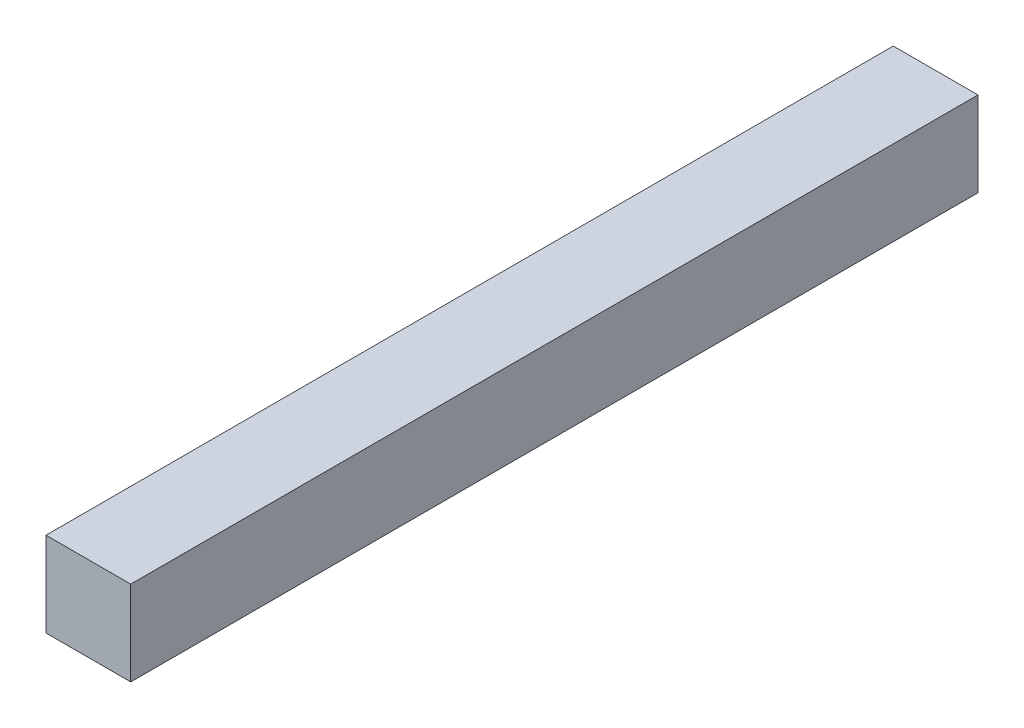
ISO-10303-21;
HEADER;
FILE_DESCRIPTION(('STEP AP214'),'2;1');
FILE_NAME('part.step','',(''),(''),'','','');
FILE_SCHEMA(('AUTOMOTIVE_DESIGN { 1 0 10303 214 1 1 1 1 }'));
ENDSEC;
DATA;
#1=APPLICATION_CONTEXT('core data for automotive mechanical design processes');
#2=APPLICATION_PROTOCOL_DEFINITION('international standard','automotive_design',2000,#1);
#3=PRODUCT_CONTEXT('',#1,'mechanical');
#4=PRODUCT('Part','Part','',(#3));
#5=PRODUCT_RELATED_PRODUCT_CATEGORY('part','',(#4));
#6=PRODUCT_DEFINITION_FORMATION('','',#4);
#7=PRODUCT_DEFINITION_CONTEXT('part definition',#1,'design');
#8=PRODUCT_DEFINITION('design','',#6,#7);
#9=PRODUCT_DEFINITION_SHAPE('','',#8);
#10=(LENGTH_UNIT() NAMED_UNIT(*) SI_UNIT(.MILLI.,.METRE.));
#11=(NAMED_UNIT(*) PLANE_ANGLE_UNIT() SI_UNIT($,.RADIAN.));
#12=(NAMED_UNIT(*) SI_UNIT($,.STERADIAN.) SOLID_ANGLE_UNIT());
#13=UNCERTAINTY_MEASURE_WITH_UNIT(LENGTH_MEASURE(1.E-05),#10,'distance_accuracy_value','');
#14=(GEOMETRIC_REPRESENTATION_CONTEXT(3) GLOBAL_UNCERTAINTY_ASSIGNED_CONTEXT((#13)) GLOBAL_UNIT_ASSIGNED_CONTEXT((#10,
#11,#12)) REPRESENTATION_CONTEXT('',''));
#15=CARTESIAN_POINT('',(0.,0.,0.));
#16=DIRECTION('',(0.,0.,1.));
#17=DIRECTION('',(1.,0.,0.));
#18=AXIS2_PLACEMENT_3D('',#15,#16,#17);
#19=CARTESIAN_POINT('',(0.,0.,-254.));
#20=DIRECTION('',(-1.,0.,0.));
#21=DIRECTION('',(0.,0.,1.));
#22=AXIS2_PLACEMENT_3D('',#19,#20,#21);
#23=PLANE('',#22);
#24=DIRECTION('',(0.,-1.,0.));
#25=VECTOR('',#24,1.);
#26=CARTESIAN_POINT('',(0.,0.,0.));
#27=LINE('',#26,#25);
#28=CARTESIAN_POINT('',(0.,25.4,0.));
#29=VERTEX_POINT('',#28);
#30=CARTESIAN_POINT('',(0.,0.,0.));
#31=VERTEX_POINT('',#30);
#32=EDGE_CURVE('E97',#29,#31,#27,.T.);
#33=ORIENTED_EDGE('',*,*,#32,.F.);
#34=DIRECTION('',(0.,0.,1.));
#35=VECTOR('',#34,1.);
#36=CARTESIAN_POINT('',(0.,25.4,-254.));
#37=LINE('',#36,#35);
#38=CARTESIAN_POINT('',(0.,25.4,-254.));
#39=VERTEX_POINT('',#38);
#40=EDGE_CURVE('E11',#39,#29,#37,.T.);
#41=ORIENTED_EDGE('',*,*,#40,.F.);
#42=DIRECTION('',(0.,-1.,0.));
#43=VECTOR('',#42,1.);
#44=CARTESIAN_POINT('',(0.,0.,-254.));
#45=LINE('',#44,#43);
#46=CARTESIAN_POINT('',(0.,0.,-254.));
#47=VERTEX_POINT('',#46);
#48=EDGE_CURVE('E91',#39,#47,#45,.T.);
#49=ORIENTED_EDGE('',*,*,#48,.T.);
#50=DIRECTION('',(0.,0.,1.));
#51=VECTOR('',#50,1.);
#52=CARTESIAN_POINT('',(0.,0.,-254.));
#53=LINE('',#52,#51);
#54=EDGE_CURVE('E36',#47,#31,#53,.T.);
#55=ORIENTED_EDGE('',*,*,#54,.T.);
#56=EDGE_LOOP('',(#33,#41,#49,#55));
#57=FACE_BOUND('',#56,.T.);
#58=ADVANCED_FACE('F33',(#57),#23,.T.);
#59=CARTESIAN_POINT('',(0.,25.4,-254.));
#60=DIRECTION('',(0.,1.,0.));
#61=DIRECTION('',(0.,0.,1.));
#62=AXIS2_PLACEMENT_3D('',#59,#60,#61);
#63=PLANE('',#62);
#64=DIRECTION('',(-1.,0.,0.));
#65=VECTOR('',#64,1.);
#66=CARTESIAN_POINT('',(0.,25.4,0.));
#67=LINE('',#66,#65);
#68=CARTESIAN_POINT('',(25.4,25.4,0.));
#69=VERTEX_POINT('',#68);
#70=EDGE_CURVE('E93',#69,#29,#67,.T.);
#71=ORIENTED_EDGE('',*,*,#70,.F.);
#72=DIRECTION('',(0.,0.,1.));
#73=VECTOR('',#72,1.);
#74=CARTESIAN_POINT('',(25.4,25.4,-254.));
#75=LINE('',#74,#73);
#76=CARTESIAN_POINT('',(25.4,25.4,-254.));
#77=VERTEX_POINT('',#76);
#78=EDGE_CURVE('E42',#77,#69,#75,.T.);
#79=ORIENTED_EDGE('',*,*,#78,.F.);
#80=DIRECTION('',(-1.,0.,0.));
#81=VECTOR('',#80,1.);
#82=CARTESIAN_POINT('',(0.,25.4,-254.));
#83=LINE('',#82,#81);
#84=EDGE_CURVE('E88',#77,#39,#83,.T.);
#85=ORIENTED_EDGE('',*,*,#84,.T.);
#86=ORIENTED_EDGE('',*,*,#40,.T.);
#87=EDGE_LOOP('',(#71,#79,#85,#86));
#88=FACE_BOUND('',#87,.T.);
#89=ADVANCED_FACE('F107',(#88),#63,.T.);
#90=CARTESIAN_POINT('',(25.4,0.,-254.));
#91=DIRECTION('',(1.,0.,0.));
#92=DIRECTION('',(0.,0.,-1.));
#93=AXIS2_PLACEMENT_3D('',#90,#91,#92);
#94=PLANE('',#93);
#95=DIRECTION('',(0.,1.,0.));
#96=VECTOR('',#95,1.);
#97=CARTESIAN_POINT('',(25.4,0.,0.));
#98=LINE('',#97,#96);
#99=CARTESIAN_POINT('',(25.4,0.,0.));
#100=VERTEX_POINT('',#99);
#101=EDGE_CURVE('E83',#100,#69,#98,.T.);
#102=ORIENTED_EDGE('',*,*,#101,.F.);
#103=DIRECTION('',(0.,0.,1.));
#104=VECTOR('',#103,1.);
#105=CARTESIAN_POINT('',(25.4,0.,-254.));
#106=LINE('',#105,#104);
#107=CARTESIAN_POINT('',(25.4,0.,-254.));
#108=VERTEX_POINT('',#107);
#109=EDGE_CURVE('E78',#108,#100,#106,.T.);
#110=ORIENTED_EDGE('',*,*,#109,.F.);
#111=DIRECTION('',(0.,1.,0.));
#112=VECTOR('',#111,1.);
#113=CARTESIAN_POINT('',(25.4,0.,-254.));
#114=LINE('',#113,#112);
#115=EDGE_CURVE('E81',#108,#77,#114,.T.);
#116=ORIENTED_EDGE('',*,*,#115,.T.);
#117=ORIENTED_EDGE('',*,*,#78,.T.);
#118=EDGE_LOOP('',(#102,#110,#116,#117));
#119=FACE_BOUND('',#118,.T.);
#120=ADVANCED_FACE('F80',(#119),#94,.T.);
#121=CARTESIAN_POINT('',(0.,0.,-254.));
#122=DIRECTION('',(0.,-1.,0.));
#123=DIRECTION('',(0.,0.,-1.));
#124=AXIS2_PLACEMENT_3D('',#121,#122,#123);
#125=PLANE('',#124);
#126=DIRECTION('',(1.,0.,0.));
#127=VECTOR('',#126,1.);
#128=CARTESIAN_POINT('',(0.,0.,0.));
#129=LINE('',#128,#127);
#130=EDGE_CURVE('E100',#31,#100,#129,.T.);
#131=ORIENTED_EDGE('',*,*,#130,.F.);
#132=ORIENTED_EDGE('',*,*,#54,.F.);
#133=DIRECTION('',(1.,0.,0.));
#134=VECTOR('',#133,1.);
#135=CARTESIAN_POINT('',(0.,0.,-254.));
#136=LINE('',#135,#134);
#137=EDGE_CURVE('E87',#47,#108,#136,.T.);
#138=ORIENTED_EDGE('',*,*,#137,.T.);
#139=ORIENTED_EDGE('',*,*,#109,.T.);
#140=EDGE_LOOP('',(#131,#132,#138,#139));
#141=FACE_BOUND('',#140,.T.);
#142=ADVANCED_FACE('F90',(#141),#125,.T.);
#143=CARTESIAN_POINT('',(0.,25.4,-254.));
#144=DIRECTION('',(0.,0.,-1.));
#145=DIRECTION('',(-1.,0.,0.));
#146=AXIS2_PLACEMENT_3D('',#143,#144,#145);
#147=PLANE('',#146);
#148=ORIENTED_EDGE('',*,*,#48,.F.);
#149=ORIENTED_EDGE('',*,*,#84,.F.);
#150=ORIENTED_EDGE('',*,*,#115,.F.);
#151=ORIENTED_EDGE('',*,*,#137,.F.);
#152=EDGE_LOOP('',(#148,#149,#150,#151));
#153=FACE_BOUND('',#152,.T.);
#154=ADVANCED_FACE('F86',(#153),#147,.T.);
#155=CARTESIAN_POINT('',(0.,25.4,0.));
#156=DIRECTION('',(0.,0.,-1.));
#157=DIRECTION('',(-1.,0.,0.));
#158=AXIS2_PLACEMENT_3D('',#155,#156,#157);
#159=PLANE('',#158);
#160=ORIENTED_EDGE('',*,*,#32,.T.);
#161=ORIENTED_EDGE('',*,*,#130,.T.);
#162=ORIENTED_EDGE('',*,*,#101,.T.);
#163=ORIENTED_EDGE('',*,*,#70,.T.);
#164=EDGE_LOOP('',(#160,#161,#162,#163));
#165=FACE_BOUND('',#164,.T.);
#166=ADVANCED_FACE('F106',(#165),#159,.F.);
#167=CLOSED_SHELL('',(#58,#89,#120,#142,#154,#166));
#168=MANIFOLD_SOLID_BREP('B2',#167);
#169=ADVANCED_BREP_SHAPE_REPRESENTATION('',(#18,#168),#14);
#170=SHAPE_DEFINITION_REPRESENTATION(#9,#169);
ENDSEC;
END-ISO-10303-21;
